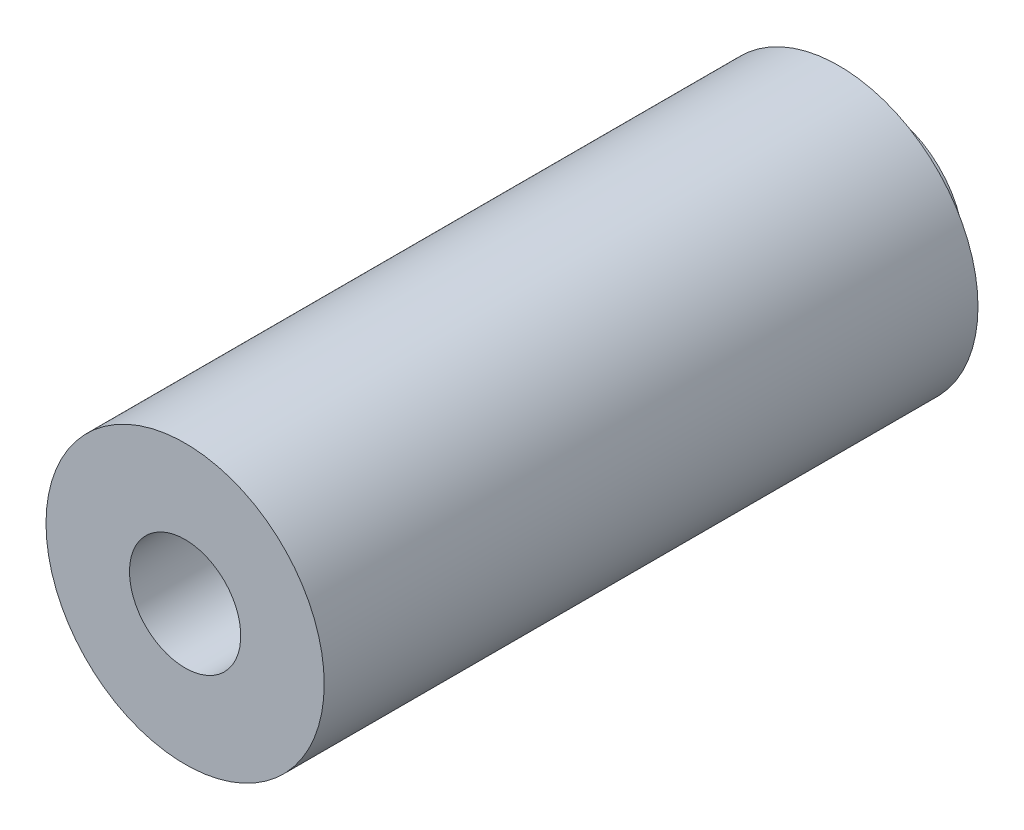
ISO-10303-21;
HEADER;
FILE_DESCRIPTION(('STEP AP214'),'2;1');
FILE_NAME('part.step','',(''),(''),'','','');
FILE_SCHEMA(('AUTOMOTIVE_DESIGN { 1 0 10303 214 1 1 1 1 }'));
ENDSEC;
DATA;
#1=APPLICATION_CONTEXT('core data for automotive mechanical design processes');
#2=APPLICATION_PROTOCOL_DEFINITION('international standard','automotive_design',2000,#1);
#3=PRODUCT_CONTEXT('',#1,'mechanical');
#4=PRODUCT('Part','Part','',(#3));
#5=PRODUCT_RELATED_PRODUCT_CATEGORY('part','',(#4));
#6=PRODUCT_DEFINITION_FORMATION('','',#4);
#7=PRODUCT_DEFINITION_CONTEXT('part definition',#1,'design');
#8=PRODUCT_DEFINITION('design','',#6,#7);
#9=PRODUCT_DEFINITION_SHAPE('','',#8);
#10=(LENGTH_UNIT() NAMED_UNIT(*) SI_UNIT(.MILLI.,.METRE.));
#11=(NAMED_UNIT(*) PLANE_ANGLE_UNIT() SI_UNIT($,.RADIAN.));
#12=(NAMED_UNIT(*) SI_UNIT($,.STERADIAN.) SOLID_ANGLE_UNIT());
#13=UNCERTAINTY_MEASURE_WITH_UNIT(LENGTH_MEASURE(1.E-05),#10,'distance_accuracy_value','');
#14=(GEOMETRIC_REPRESENTATION_CONTEXT(3) GLOBAL_UNCERTAINTY_ASSIGNED_CONTEXT((#13)) GLOBAL_UNIT_ASSIGNED_CONTEXT((#10,
#11,#12)) REPRESENTATION_CONTEXT('',''));
#15=CARTESIAN_POINT('',(0.,0.,0.));
#16=DIRECTION('',(0.,0.,1.));
#17=DIRECTION('',(1.,0.,0.));
#18=AXIS2_PLACEMENT_3D('',#15,#16,#17);
#19=CARTESIAN_POINT('',(0.,0.,45.));
#20=DIRECTION('',(0.,0.,1.));
#21=DIRECTION('',(1.,0.,0.));
#22=AXIS2_PLACEMENT_3D('',#19,#20,#21);
#23=CYLINDRICAL_SURFACE('',#22,5.);
#24=CARTESIAN_POINT('',(0.,0.,25.));
#25=DIRECTION('',(0.,0.,1.));
#26=DIRECTION('',(1.,0.,0.));
#27=AXIS2_PLACEMENT_3D('',#24,#25,#26);
#28=CIRCLE('',#27,5.);
#29=CARTESIAN_POINT('',(5.,0.,25.));
#30=VERTEX_POINT('',#29);
#31=EDGE_CURVE('E8',#30,#30,#28,.T.);
#32=ORIENTED_EDGE('',*,*,#31,.F.);
#33=EDGE_LOOP('',(#32));
#34=FACE_BOUND('',#33,.T.);
#35=CARTESIAN_POINT('',(0.,0.,1.5));
#36=DIRECTION('',(0.,0.,-1.));
#37=DIRECTION('',(-1.,0.,0.));
#38=AXIS2_PLACEMENT_3D('',#35,#36,#37);
#39=CIRCLE('',#38,5.);
#40=CARTESIAN_POINT('',(-5.,0.,1.5));
#41=VERTEX_POINT('',#40);
#42=EDGE_CURVE('E28',#41,#41,#39,.F.);
#43=ORIENTED_EDGE('',*,*,#42,.T.);
#44=EDGE_LOOP('',(#43));
#45=FACE_BOUND('',#44,.T.);
#46=ADVANCED_FACE('F12',(#34,#45),#23,.T.);
#47=CARTESIAN_POINT('',(0.,0.,25.));
#48=DIRECTION('',(0.,0.,1.));
#49=DIRECTION('',(1.,0.,0.));
#50=AXIS2_PLACEMENT_3D('',#47,#48,#49);
#51=PLANE('',#50);
#52=ORIENTED_EDGE('',*,*,#31,.T.);
#53=EDGE_LOOP('',(#52));
#54=FACE_BOUND('',#53,.T.);
#55=CARTESIAN_POINT('',(0.,0.,25.));
#56=DIRECTION('',(0.,0.,-1.));
#57=DIRECTION('',(-1.,0.,0.));
#58=AXIS2_PLACEMENT_3D('',#55,#56,#57);
#59=CIRCLE('',#58,2.);
#60=CARTESIAN_POINT('',(-2.,0.,25.));
#61=VERTEX_POINT('',#60);
#62=EDGE_CURVE('E25',#61,#61,#59,.T.);
#63=ORIENTED_EDGE('',*,*,#62,.T.);
#64=EDGE_LOOP('',(#63));
#65=FACE_BOUND('',#64,.T.);
#66=ADVANCED_FACE('F41',(#54,#65),#51,.T.);
#67=CARTESIAN_POINT('',(0.,0.,16.));
#68=DIRECTION('',(0.,0.,1.));
#69=DIRECTION('',(1.,0.,0.));
#70=AXIS2_PLACEMENT_3D('',#67,#68,#69);
#71=CYLINDRICAL_SURFACE('',#70,2.);
#72=CARTESIAN_POINT('',(0.,0.,16.));
#73=DIRECTION('',(0.,0.,-1.));
#74=DIRECTION('',(-1.,0.,0.));
#75=AXIS2_PLACEMENT_3D('',#72,#73,#74);
#76=CIRCLE('',#75,2.);
#77=CARTESIAN_POINT('',(-2.,0.,16.));
#78=VERTEX_POINT('',#77);
#79=EDGE_CURVE('E20',#78,#78,#76,.T.);
#80=ORIENTED_EDGE('',*,*,#79,.T.);
#81=EDGE_LOOP('',(#80));
#82=FACE_BOUND('',#81,.T.);
#83=ORIENTED_EDGE('',*,*,#62,.F.);
#84=EDGE_LOOP('',(#83));
#85=FACE_BOUND('',#84,.T.);
#86=ADVANCED_FACE('F43',(#82,#85),#71,.F.);
#87=CARTESIAN_POINT('',(0.,0.,16.));
#88=DIRECTION('',(0.,0.,-1.));
#89=DIRECTION('',(-1.,0.,0.));
#90=AXIS2_PLACEMENT_3D('',#87,#88,#89);
#91=PLANE('',#90);
#92=ORIENTED_EDGE('',*,*,#79,.F.);
#93=EDGE_LOOP('',(#92));
#94=FACE_BOUND('',#93,.T.);
#95=ADVANCED_FACE('F45',(#94),#91,.F.);
#96=CARTESIAN_POINT('',(0.,3.,1.5));
#97=DIRECTION('',(0.,0.,-1.));
#98=DIRECTION('',(-1.,0.,0.));
#99=AXIS2_PLACEMENT_3D('',#96,#97,#98);
#100=PLANE('',#99);
#101=ORIENTED_EDGE('',*,*,#42,.F.);
#102=EDGE_LOOP('',(#101));
#103=FACE_BOUND('',#102,.T.);
#104=CARTESIAN_POINT('',(0.,0.,1.5));
#105=DIRECTION('',(0.,0.,-1.));
#106=DIRECTION('',(-1.,0.,0.));
#107=AXIS2_PLACEMENT_3D('',#104,#105,#106);
#108=CIRCLE('',#107,3.);
#109=CARTESIAN_POINT('',(-3.,0.,1.5));
#110=VERTEX_POINT('',#109);
#111=EDGE_CURVE('E30',#110,#110,#108,.T.);
#112=ORIENTED_EDGE('',*,*,#111,.F.);
#113=EDGE_LOOP('',(#112));
#114=FACE_BOUND('',#113,.T.);
#115=ADVANCED_FACE('F48',(#103,#114),#100,.T.);
#116=CARTESIAN_POINT('',(0.,0.,-15.));
#117=DIRECTION('',(0.,0.,-1.));
#118=DIRECTION('',(-1.,0.,0.));
#119=AXIS2_PLACEMENT_3D('',#116,#117,#118);
#120=CYLINDRICAL_SURFACE('',#119,3.);
#121=CARTESIAN_POINT('',(0.,0.,0.));
#122=DIRECTION('',(0.,0.,-1.));
#123=DIRECTION('',(-1.,0.,0.));
#124=AXIS2_PLACEMENT_3D('',#121,#122,#123);
#125=CIRCLE('',#124,3.);
#126=CARTESIAN_POINT('',(-3.,0.,0.));
#127=VERTEX_POINT('',#126);
#128=EDGE_CURVE('E16',#127,#127,#125,.F.);
#129=ORIENTED_EDGE('',*,*,#128,.T.);
#130=EDGE_LOOP('',(#129));
#131=FACE_BOUND('',#130,.T.);
#132=ORIENTED_EDGE('',*,*,#111,.T.);
#133=EDGE_LOOP('',(#132));
#134=FACE_BOUND('',#133,.T.);
#135=ADVANCED_FACE('F58',(#131,#134),#120,.T.);
#136=CARTESIAN_POINT('',(5.,0.,0.));
#137=DIRECTION('',(0.,0.,-1.));
#138=DIRECTION('',(-1.,0.,0.));
#139=AXIS2_PLACEMENT_3D('',#136,#137,#138);
#140=PLANE('',#139);
#141=ORIENTED_EDGE('',*,*,#128,.F.);
#142=EDGE_LOOP('',(#141));
#143=FACE_BOUND('',#142,.T.);
#144=ADVANCED_FACE('F14',(#143),#140,.T.);
#145=CLOSED_SHELL('',(#46,#66,#86,#95,#115,#135,#144));
#146=MANIFOLD_SOLID_BREP('B1',#145);
#147=ADVANCED_BREP_SHAPE_REPRESENTATION('',(#18,#146),#14);
#148=SHAPE_DEFINITION_REPRESENTATION(#9,#147);
ENDSEC;
END-ISO-10303-21;
